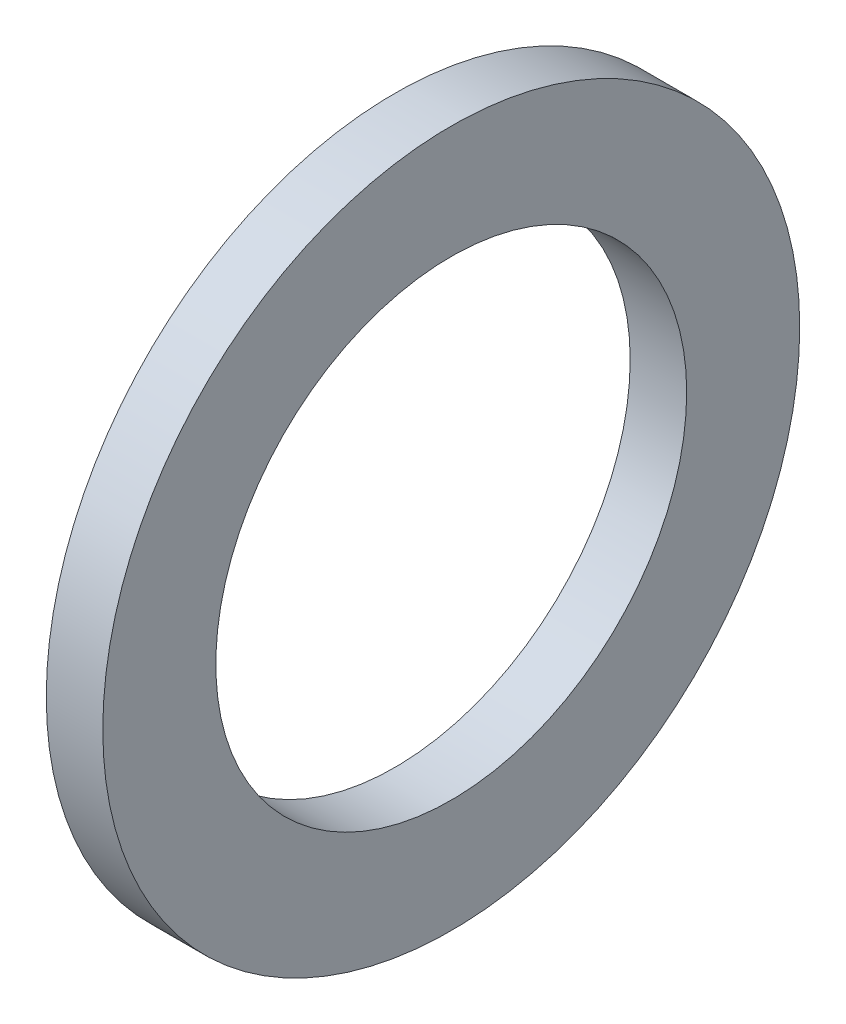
ISO-10303-21;
HEADER;
FILE_DESCRIPTION(('STEP AP214'),'2;1');
FILE_NAME('part.step','',(''),(''),'','','');
FILE_SCHEMA(('AUTOMOTIVE_DESIGN { 1 0 10303 214 1 1 1 1 }'));
ENDSEC;
DATA;
#1=APPLICATION_CONTEXT('core data for automotive mechanical design processes');
#2=APPLICATION_PROTOCOL_DEFINITION('international standard','automotive_design',2000,#1);
#3=PRODUCT_CONTEXT('',#1,'mechanical');
#4=PRODUCT('Part','Part','',(#3));
#5=PRODUCT_RELATED_PRODUCT_CATEGORY('part','',(#4));
#6=PRODUCT_DEFINITION_FORMATION('','',#4);
#7=PRODUCT_DEFINITION_CONTEXT('part definition',#1,'design');
#8=PRODUCT_DEFINITION('design','',#6,#7);
#9=PRODUCT_DEFINITION_SHAPE('','',#8);
#10=(LENGTH_UNIT() NAMED_UNIT(*) SI_UNIT(.MILLI.,.METRE.));
#11=(NAMED_UNIT(*) PLANE_ANGLE_UNIT() SI_UNIT($,.RADIAN.));
#12=(NAMED_UNIT(*) SI_UNIT($,.STERADIAN.) SOLID_ANGLE_UNIT());
#13=UNCERTAINTY_MEASURE_WITH_UNIT(LENGTH_MEASURE(1.E-05),#10,'distance_accuracy_value','');
#14=(GEOMETRIC_REPRESENTATION_CONTEXT(3) GLOBAL_UNCERTAINTY_ASSIGNED_CONTEXT((#13)) GLOBAL_UNIT_ASSIGNED_CONTEXT((#10,
#11,#12)) REPRESENTATION_CONTEXT('',''));
#15=CARTESIAN_POINT('',(0.,0.,0.));
#16=DIRECTION('',(0.,0.,1.));
#17=DIRECTION('',(1.,0.,0.));
#18=AXIS2_PLACEMENT_3D('',#15,#16,#17);
#19=CARTESIAN_POINT('',(3.,0.,0.));
#20=DIRECTION('',(1.,0.,0.));
#21=DIRECTION('',(0.,0.,-1.));
#22=AXIS2_PLACEMENT_3D('',#19,#20,#21);
#23=PLANE('',#22);
#24=CARTESIAN_POINT('',(3.,0.,0.));
#25=DIRECTION('',(1.,0.,0.));
#26=DIRECTION('',(0.,0.,-1.));
#27=AXIS2_PLACEMENT_3D('',#24,#25,#26);
#28=CIRCLE('',#27,18.5);
#29=CARTESIAN_POINT('',(3.,0.,-18.5));
#30=VERTEX_POINT('',#29);
#31=EDGE_CURVE('E10',#30,#30,#28,.T.);
#32=ORIENTED_EDGE('',*,*,#31,.T.);
#33=EDGE_LOOP('',(#32));
#34=FACE_BOUND('',#33,.T.);
#35=CARTESIAN_POINT('',(3.,0.,0.));
#36=DIRECTION('',(1.,0.,0.));
#37=DIRECTION('',(0.,0.,-1.));
#38=AXIS2_PLACEMENT_3D('',#35,#36,#37);
#39=CIRCLE('',#38,12.5);
#40=CARTESIAN_POINT('',(3.,0.,-12.5));
#41=VERTEX_POINT('',#40);
#42=EDGE_CURVE('E36',#41,#41,#39,.T.);
#43=ORIENTED_EDGE('',*,*,#42,.F.);
#44=EDGE_LOOP('',(#43));
#45=FACE_BOUND('',#44,.T.);
#46=ADVANCED_FACE('F25',(#34,#45),#23,.T.);
#47=CARTESIAN_POINT('',(0.,0.,0.));
#48=DIRECTION('',(1.,0.,0.));
#49=DIRECTION('',(0.,0.,-1.));
#50=AXIS2_PLACEMENT_3D('',#47,#48,#49);
#51=PLANE('',#50);
#52=CARTESIAN_POINT('',(0.,0.,0.));
#53=DIRECTION('',(1.,0.,0.));
#54=DIRECTION('',(0.,0.,-1.));
#55=AXIS2_PLACEMENT_3D('',#52,#53,#54);
#56=CIRCLE('',#55,18.5);
#57=CARTESIAN_POINT('',(0.,0.,-18.5));
#58=VERTEX_POINT('',#57);
#59=EDGE_CURVE('E32',#58,#58,#56,.T.);
#60=ORIENTED_EDGE('',*,*,#59,.F.);
#61=EDGE_LOOP('',(#60));
#62=FACE_BOUND('',#61,.T.);
#63=CARTESIAN_POINT('',(0.,0.,0.));
#64=DIRECTION('',(1.,0.,0.));
#65=DIRECTION('',(0.,0.,-1.));
#66=AXIS2_PLACEMENT_3D('',#63,#64,#65);
#67=CIRCLE('',#66,12.5);
#68=CARTESIAN_POINT('',(0.,0.,-12.5));
#69=VERTEX_POINT('',#68);
#70=EDGE_CURVE('E40',#69,#69,#67,.T.);
#71=ORIENTED_EDGE('',*,*,#70,.T.);
#72=EDGE_LOOP('',(#71));
#73=FACE_BOUND('',#72,.T.);
#74=ADVANCED_FACE('F46',(#62,#73),#51,.F.);
#75=CARTESIAN_POINT('',(3.,0.,0.));
#76=DIRECTION('',(-1.,0.,0.));
#77=DIRECTION('',(0.,0.,1.));
#78=AXIS2_PLACEMENT_3D('',#75,#76,#77);
#79=CYLINDRICAL_SURFACE('',#78,18.5);
#80=ORIENTED_EDGE('',*,*,#31,.F.);
#81=EDGE_LOOP('',(#80));
#82=FACE_BOUND('',#81,.T.);
#83=ORIENTED_EDGE('',*,*,#59,.T.);
#84=EDGE_LOOP('',(#83));
#85=FACE_BOUND('',#84,.T.);
#86=ADVANCED_FACE('F27',(#82,#85),#79,.T.);
#87=CARTESIAN_POINT('',(3.,0.,0.));
#88=DIRECTION('',(-1.,0.,0.));
#89=DIRECTION('',(0.,0.,1.));
#90=AXIS2_PLACEMENT_3D('',#87,#88,#89);
#91=CYLINDRICAL_SURFACE('',#90,12.5);
#92=ORIENTED_EDGE('',*,*,#42,.T.);
#93=EDGE_LOOP('',(#92));
#94=FACE_BOUND('',#93,.T.);
#95=ORIENTED_EDGE('',*,*,#70,.F.);
#96=EDGE_LOOP('',(#95));
#97=FACE_BOUND('',#96,.T.);
#98=ADVANCED_FACE('F48',(#94,#97),#91,.F.);
#99=CLOSED_SHELL('',(#46,#74,#86,#98));
#100=MANIFOLD_SOLID_BREP('B2',#99);
#101=ADVANCED_BREP_SHAPE_REPRESENTATION('',(#18,#100),#14);
#102=SHAPE_DEFINITION_REPRESENTATION(#9,#101);
ENDSEC;
END-ISO-10303-21;
